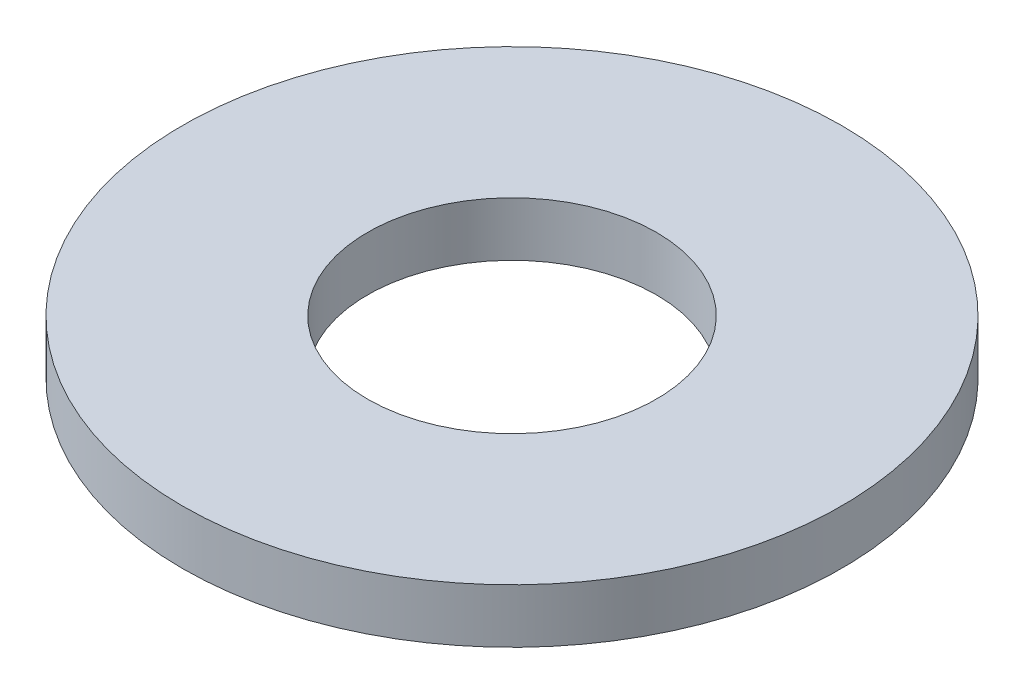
ISO-10303-21;
HEADER;
FILE_DESCRIPTION(('STEP AP214'),'2;1');
FILE_NAME('part.step','',(''),(''),'','','');
FILE_SCHEMA(('AUTOMOTIVE_DESIGN { 1 0 10303 214 1 1 1 1 }'));
ENDSEC;
DATA;
#1=APPLICATION_CONTEXT('core data for automotive mechanical design processes');
#2=APPLICATION_PROTOCOL_DEFINITION('international standard','automotive_design',2000,#1);
#3=PRODUCT_CONTEXT('',#1,'mechanical');
#4=PRODUCT('Part','Part','',(#3));
#5=PRODUCT_RELATED_PRODUCT_CATEGORY('part','',(#4));
#6=PRODUCT_DEFINITION_FORMATION('','',#4);
#7=PRODUCT_DEFINITION_CONTEXT('part definition',#1,'design');
#8=PRODUCT_DEFINITION('design','',#6,#7);
#9=PRODUCT_DEFINITION_SHAPE('','',#8);
#10=(LENGTH_UNIT() NAMED_UNIT(*) SI_UNIT(.MILLI.,.METRE.));
#11=(NAMED_UNIT(*) PLANE_ANGLE_UNIT() SI_UNIT($,.RADIAN.));
#12=(NAMED_UNIT(*) SI_UNIT($,.STERADIAN.) SOLID_ANGLE_UNIT());
#13=UNCERTAINTY_MEASURE_WITH_UNIT(LENGTH_MEASURE(1.E-05),#10,'distance_accuracy_value','');
#14=(GEOMETRIC_REPRESENTATION_CONTEXT(3) GLOBAL_UNCERTAINTY_ASSIGNED_CONTEXT((#13)) GLOBAL_UNIT_ASSIGNED_CONTEXT((#10,
#11,#12)) REPRESENTATION_CONTEXT('',''));
#15=CARTESIAN_POINT('',(0.,0.,0.));
#16=DIRECTION('',(0.,0.,1.));
#17=DIRECTION('',(1.,0.,0.));
#18=AXIS2_PLACEMENT_3D('',#15,#16,#17);
#19=CARTESIAN_POINT('',(0.,0.6,0.));
#20=DIRECTION('',(0.,1.,0.));
#21=DIRECTION('',(0.,0.,1.));
#22=AXIS2_PLACEMENT_3D('',#19,#20,#21);
#23=PLANE('',#22);
#24=CARTESIAN_POINT('',(0.,0.6,0.));
#25=DIRECTION('',(0.,1.,0.));
#26=DIRECTION('',(0.,0.,1.));
#27=AXIS2_PLACEMENT_3D('',#24,#25,#26);
#28=CIRCLE('',#27,3.65);
#29=CARTESIAN_POINT('',(0.,0.6,3.65));
#30=VERTEX_POINT('',#29);
#31=EDGE_CURVE('E10',#30,#30,#28,.T.);
#32=ORIENTED_EDGE('',*,*,#31,.T.);
#33=EDGE_LOOP('',(#32));
#34=FACE_BOUND('',#33,.T.);
#35=CARTESIAN_POINT('',(0.,0.6,0.));
#36=DIRECTION('',(0.,1.,0.));
#37=DIRECTION('',(0.,0.,1.));
#38=AXIS2_PLACEMENT_3D('',#35,#36,#37);
#39=CIRCLE('',#38,1.6);
#40=CARTESIAN_POINT('',(0.,0.6,1.6));
#41=VERTEX_POINT('',#40);
#42=EDGE_CURVE('E42',#41,#41,#39,.T.);
#43=ORIENTED_EDGE('',*,*,#42,.F.);
#44=EDGE_LOOP('',(#43));
#45=FACE_BOUND('',#44,.T.);
#46=ADVANCED_FACE('F31',(#34,#45),#23,.T.);
#47=CARTESIAN_POINT('',(0.,0.,0.));
#48=DIRECTION('',(0.,1.,0.));
#49=DIRECTION('',(0.,0.,1.));
#50=AXIS2_PLACEMENT_3D('',#47,#48,#49);
#51=PLANE('',#50);
#52=CARTESIAN_POINT('',(0.,0.,0.));
#53=DIRECTION('',(0.,1.,0.));
#54=DIRECTION('',(0.,0.,1.));
#55=AXIS2_PLACEMENT_3D('',#52,#53,#54);
#56=CIRCLE('',#55,3.65);
#57=CARTESIAN_POINT('',(0.,0.,3.65));
#58=VERTEX_POINT('',#57);
#59=EDGE_CURVE('E35',#58,#58,#56,.T.);
#60=ORIENTED_EDGE('',*,*,#59,.F.);
#61=EDGE_LOOP('',(#60));
#62=FACE_BOUND('',#61,.T.);
#63=CARTESIAN_POINT('',(0.,0.,0.));
#64=DIRECTION('',(0.,1.,0.));
#65=DIRECTION('',(0.,0.,1.));
#66=AXIS2_PLACEMENT_3D('',#63,#64,#65);
#67=CIRCLE('',#66,1.6);
#68=CARTESIAN_POINT('',(0.,0.,1.6));
#69=VERTEX_POINT('',#68);
#70=EDGE_CURVE('E44',#69,#69,#67,.T.);
#71=ORIENTED_EDGE('',*,*,#70,.T.);
#72=EDGE_LOOP('',(#71));
#73=FACE_BOUND('',#72,.T.);
#74=ADVANCED_FACE('F54',(#62,#73),#51,.F.);
#75=CARTESIAN_POINT('',(0.,0.6,0.));
#76=DIRECTION('',(0.,-1.,0.));
#77=DIRECTION('',(0.,0.,-1.));
#78=AXIS2_PLACEMENT_3D('',#75,#76,#77);
#79=CYLINDRICAL_SURFACE('',#78,3.65);
#80=ORIENTED_EDGE('',*,*,#31,.F.);
#81=EDGE_LOOP('',(#80));
#82=FACE_BOUND('',#81,.T.);
#83=ORIENTED_EDGE('',*,*,#59,.T.);
#84=EDGE_LOOP('',(#83));
#85=FACE_BOUND('',#84,.T.);
#86=ADVANCED_FACE('F33',(#82,#85),#79,.T.);
#87=CARTESIAN_POINT('',(0.,0.6,0.));
#88=DIRECTION('',(0.,-1.,0.));
#89=DIRECTION('',(0.,0.,-1.));
#90=AXIS2_PLACEMENT_3D('',#87,#88,#89);
#91=CYLINDRICAL_SURFACE('',#90,1.6);
#92=ORIENTED_EDGE('',*,*,#42,.T.);
#93=EDGE_LOOP('',(#92));
#94=FACE_BOUND('',#93,.T.);
#95=ORIENTED_EDGE('',*,*,#70,.F.);
#96=EDGE_LOOP('',(#95));
#97=FACE_BOUND('',#96,.T.);
#98=ADVANCED_FACE('F50',(#94,#97),#91,.F.);
#99=CLOSED_SHELL('',(#46,#74,#86,#98));
#100=MANIFOLD_SOLID_BREP('B2',#99);
#101=ADVANCED_BREP_SHAPE_REPRESENTATION('',(#18,#100),#14);
#102=SHAPE_DEFINITION_REPRESENTATION(#9,#101);
ENDSEC;
END-ISO-10303-21;
